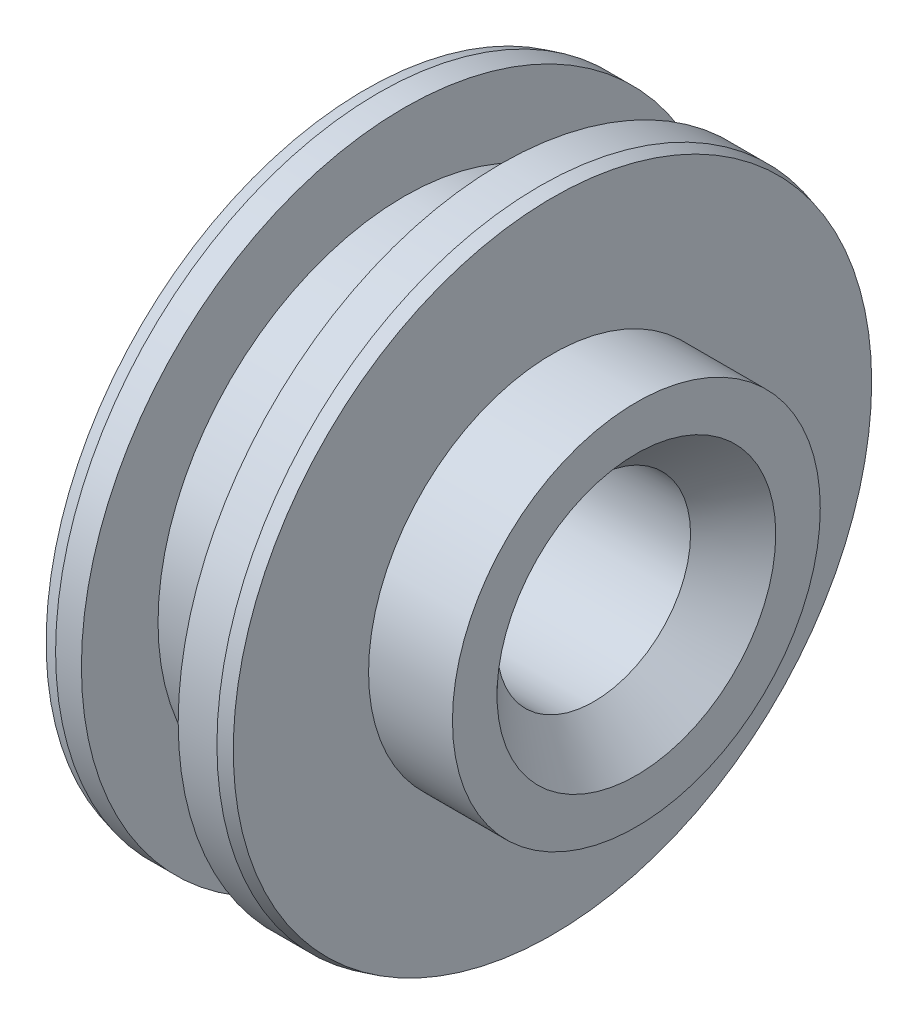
from build123d import *


with BuildPart() as part:
    # Esquisse1 → Base-R_volution (revolve)
    with BuildSketch(Plane.XY, mode=Mode.PRIVATE) as base_r_volution_sk:
        Polygon((0, 3), (0, 9.892820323), (0.4, 10), (1.2, 10), (1.2, 7.625), (4.2, 7.625), (4.2, 10), (5.4, 10), (5.8, 9.892820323), (5.8, 5.7), (8.4, 5.7), (8.4, 4.32), (7.08, 3), align=None)
    revolve(base_r_volution_sk.sketch.rotate(Axis((0, 0, 0), (-1, 0, 0)), 90), axis=Axis((0, 0, 0), (-1, 0, 0)))


solid = part.part
